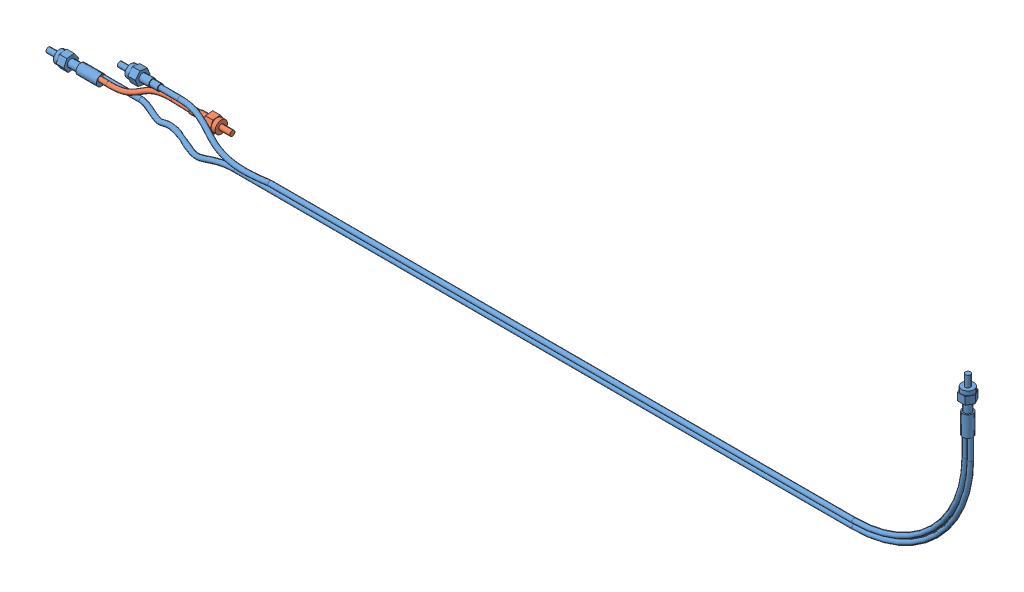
SolidWorks assembly Fiber-Extended-Assem.SLDASM, configuration Default (file format 8000). Lengths in mm.
Overall size (593.09 132.89 32.96).
2 component instances, 2 part files, 2 mates.
Components (placement in the parent):
- Equitech-Extended-Fiber-1: Equitech-Extended-Fiber.SLDPRT [Default] at origin size (593.09 132.89 25.63)
- Ref_FiberC3_LRAUV-1: Ref_FiberC3_LRAUV.sldprt [Default] at (-354.5654 -149.7132 -114.5169) x (0 -0.419433 -0.907786) z (0 -0.907786 0.419433) size (10.29 74.99 13.3)
Mates (geometry in assembly coordinates):
- Coincident1: coincident anti-aligned: plane of Equitech-Extended-Fiber-1 through (-555.5739 -121.8246 -17.0288) normal (1 0 0); plane of Ref_FiberC3_LRAUV-1 through (-555.5739 -120.6191 -16.1913) normal (-1 0 0)
- Tangent1: tangent: cylinder of Equitech-Extended-Fiber-1 through (-531.9435 -120.9372 -18.1888) axis (-1 0 0) radius 1.4605; face of Ref_FiberC3_LRAUV-1
